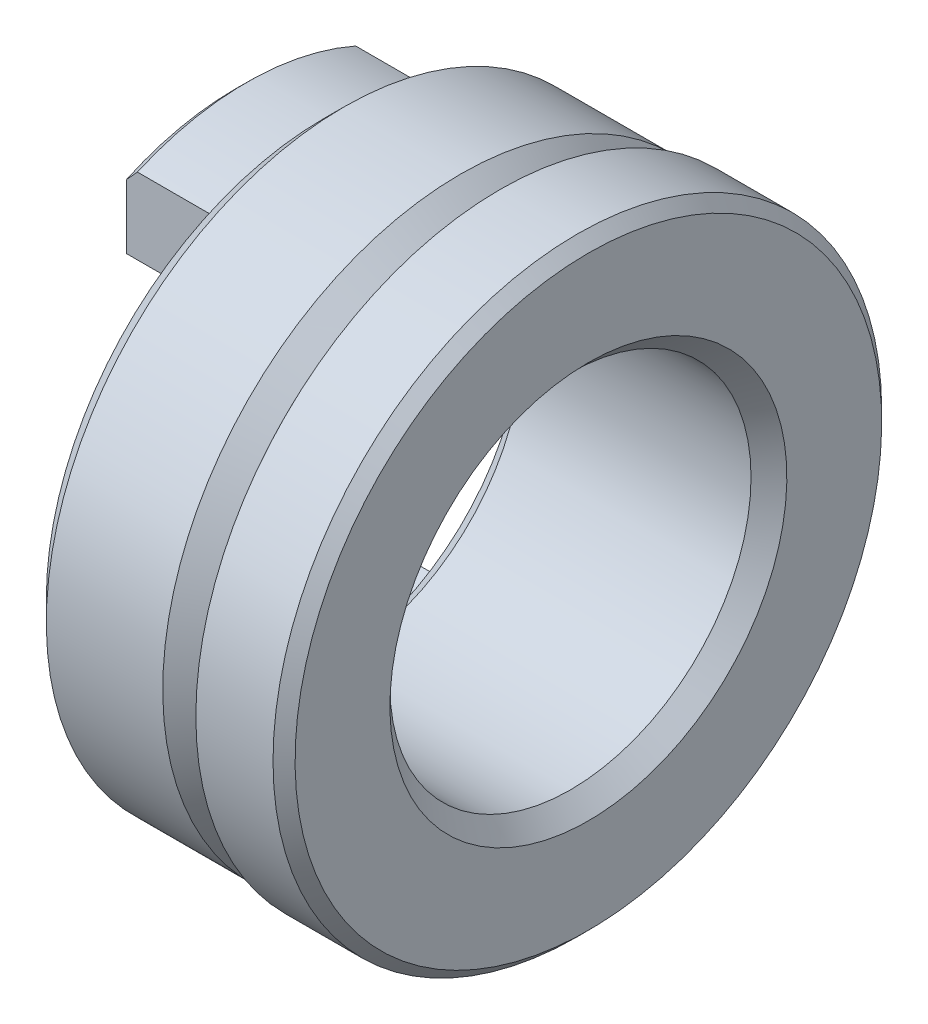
ISO-10303-21;
HEADER;
FILE_DESCRIPTION(('STEP AP214'),'2;1');
FILE_NAME('part.step','',(''),(''),'','','');
FILE_SCHEMA(('AUTOMOTIVE_DESIGN { 1 0 10303 214 1 1 1 1 }'));
ENDSEC;
DATA;
#1=APPLICATION_CONTEXT('core data for automotive mechanical design processes');
#2=APPLICATION_PROTOCOL_DEFINITION('international standard','automotive_design',2000,#1);
#3=PRODUCT_CONTEXT('',#1,'mechanical');
#4=PRODUCT('Part','Part','',(#3));
#5=PRODUCT_RELATED_PRODUCT_CATEGORY('part','',(#4));
#6=PRODUCT_DEFINITION_FORMATION('','',#4);
#7=PRODUCT_DEFINITION_CONTEXT('part definition',#1,'design');
#8=PRODUCT_DEFINITION('design','',#6,#7);
#9=PRODUCT_DEFINITION_SHAPE('','',#8);
#10=(LENGTH_UNIT() NAMED_UNIT(*) SI_UNIT(.MILLI.,.METRE.));
#11=(NAMED_UNIT(*) PLANE_ANGLE_UNIT() SI_UNIT($,.RADIAN.));
#12=(NAMED_UNIT(*) SI_UNIT($,.STERADIAN.) SOLID_ANGLE_UNIT());
#13=UNCERTAINTY_MEASURE_WITH_UNIT(LENGTH_MEASURE(1.E-05),#10,'distance_accuracy_value','');
#14=(GEOMETRIC_REPRESENTATION_CONTEXT(3) GLOBAL_UNCERTAINTY_ASSIGNED_CONTEXT((#13)) GLOBAL_UNIT_ASSIGNED_CONTEXT((#10,
#11,#12)) REPRESENTATION_CONTEXT('',''));
#15=CARTESIAN_POINT('',(0.,0.,0.));
#16=DIRECTION('',(0.,0.,1.));
#17=DIRECTION('',(1.,0.,0.));
#18=AXIS2_PLACEMENT_3D('',#15,#16,#17);
#19=CARTESIAN_POINT('',(-11.5,0.,0.));
#20=DIRECTION('',(1.,0.,0.));
#21=DIRECTION('',(0.,1.,0.));
#22=AXIS2_PLACEMENT_3D('',#19,#20,#21);
#23=CONICAL_SURFACE('',#22,12.25,0.785398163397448);
#24=CARTESIAN_POINT('',(-11.5,0.,0.));
#25=DIRECTION('',(1.,0.,0.));
#26=DIRECTION('',(0.,1.,0.));
#27=AXIS2_PLACEMENT_3D('',#24,#25,#26);
#28=CIRCLE('',#27,12.25);
#29=CARTESIAN_POINT('',(-11.5,11.2053558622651,-4.95));
#30=VERTEX_POINT('',#29);
#31=CARTESIAN_POINT('',(-11.5,11.2053558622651,4.95));
#32=VERTEX_POINT('',#31);
#33=EDGE_CURVE('E145',#30,#32,#28,.T.);
#34=ORIENTED_EDGE('',*,*,#33,.F.);
#35=CARTESIAN_POINT('',(3.20326090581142,26.4948254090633,-4.95));
#36=CARTESIAN_POINT('',(2.51381405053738,25.7934123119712,-4.95));
#37=CARTESIAN_POINT('',(1.82480125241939,25.0915713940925,-4.95));
#38=CARTESIAN_POINT('',(0.447152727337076,23.6858558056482,-4.95));
#39=CARTESIAN_POINT('',(-0.241481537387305,22.9819797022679,-4.95));
#40=CARTESIAN_POINT('',(-1.6317818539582,21.5577677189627,-4.95));
#41=CARTESIAN_POINT('',(-2.33341459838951,20.8373993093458,-4.95));
#42=CARTESIAN_POINT('',(-3.73364260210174,19.3954075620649,-4.95));
#43=CARTESIAN_POINT('',(-4.43224050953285,18.6737867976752,-4.95));
#44=CARTESIAN_POINT('',(-5.70449622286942,17.3540438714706,-4.95));
#45=CARTESIAN_POINT('',(-6.2786406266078,16.7563911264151,-4.95));
#46=CARTESIAN_POINT('',(-7.42418169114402,15.5582993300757,-4.95));
#47=CARTESIAN_POINT('',(-7.99557796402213,14.9578599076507,-4.95));
#48=CARTESIAN_POINT('',(-9.13703721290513,13.7504675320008,-4.95));
#49=CARTESIAN_POINT('',(-9.70708198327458,13.1434973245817,-4.95));
#50=CARTESIAN_POINT('',(-10.5575651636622,12.2290725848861,-4.95));
#51=CARTESIAN_POINT('',(-10.8402227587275,11.9236825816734,-4.95));
#52=CARTESIAN_POINT('',(-11.403690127,11.3112036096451,-4.95));
#53=CARTESIAN_POINT('',(-11.6844999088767,11.004114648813,-4.95));
#54=CARTESIAN_POINT('',(-12.2386008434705,10.3935530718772,-4.95));
#55=CARTESIAN_POINT('',(-12.5119347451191,10.0901192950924,-4.95));
#56=CARTESIAN_POINT('',(-13.0557524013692,9.48068414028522,-4.95));
#57=CARTESIAN_POINT('',(-13.3262360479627,9.17468266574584,-4.95));
#58=CARTESIAN_POINT('',(-13.8640261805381,8.55877296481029,-4.95));
#59=CARTESIAN_POINT('',(-14.1313249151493,8.2488579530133,-4.95));
#60=CARTESIAN_POINT('',(-14.6608555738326,7.62478406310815,-4.95));
#61=CARTESIAN_POINT('',(-14.9230881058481,7.31062570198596,-4.95));
#62=CARTESIAN_POINT('',(-15.4383054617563,6.67943613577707,-4.95));
#63=CARTESIAN_POINT('',(-15.691351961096,6.36245564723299,-4.95));
#64=CARTESIAN_POINT('',(-16.063615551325,5.88117802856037,-4.95));
#65=CARTESIAN_POINT('',(-16.1865214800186,5.71973505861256,-4.95));
#66=CARTESIAN_POINT('',(-16.4293129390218,5.39459735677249,-4.95));
#67=CARTESIAN_POINT('',(-16.5491985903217,5.2309027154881,-4.95));
#68=CARTESIAN_POINT('',(-16.784840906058,4.90144336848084,-4.95));
#69=CARTESIAN_POINT('',(-16.9006107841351,4.73568814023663,-4.95));
#70=CARTESIAN_POINT('',(-17.1275768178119,4.40103606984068,-4.95));
#71=CARTESIAN_POINT('',(-17.238772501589,4.23213890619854,-4.95));
#72=CARTESIAN_POINT('',(-17.455258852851,3.89084287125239,-4.95));
#73=CARTESIAN_POINT('',(-17.5605557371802,3.71844795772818,-4.95));
#74=CARTESIAN_POINT('',(-17.7637613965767,3.36937633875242,-4.95));
#75=CARTESIAN_POINT('',(-17.8616724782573,3.19270099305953,-4.95));
#76=CARTESIAN_POINT('',(-17.9750571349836,2.97465361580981,-4.95));
#77=CARTESIAN_POINT('',(-17.9950675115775,2.93562401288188,-4.95));
#78=CARTESIAN_POINT('',(-18.034614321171,2.85731987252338,-4.95));
#79=CARTESIAN_POINT('',(-18.0541507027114,2.81804530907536,-4.95));
#80=CARTESIAN_POINT('',(-18.1120142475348,2.69983458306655,-4.95));
#81=CARTESIAN_POINT('',(-18.1495874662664,2.62052738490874,-4.95));
#82=CARTESIAN_POINT('',(-18.2224864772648,2.46088367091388,-4.95));
#83=CARTESIAN_POINT('',(-18.257812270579,2.38054715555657,-4.95));
#84=CARTESIAN_POINT('',(-18.325952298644,2.21882193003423,-4.95));
#85=CARTESIAN_POINT('',(-18.3587666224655,2.13743325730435,-4.95));
#86=CARTESIAN_POINT('',(-18.4523269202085,1.8934719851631,-4.95));
#87=CARTESIAN_POINT('',(-18.5090216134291,1.72930986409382,-4.95));
#88=CARTESIAN_POINT('',(-18.6091069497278,1.39691062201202,-4.95));
#89=CARTESIAN_POINT('',(-18.6524970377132,1.22867333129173,-4.95));
#90=CARTESIAN_POINT('',(-18.7178372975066,0.916284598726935,-4.95));
#91=CARTESIAN_POINT('',(-18.7421164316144,0.772623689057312,-4.95));
#92=CARTESIAN_POINT('',(-18.778476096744,0.483789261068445,-4.95));
#93=CARTESIAN_POINT('',(-18.7905607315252,0.338616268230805,-4.95));
#94=CARTESIAN_POINT('',(-18.8018909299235,0.0480543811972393,-4.95));
#95=CARTESIAN_POINT('',(-18.8011622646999,-0.0973334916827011,-4.95));
#96=CARTESIAN_POINT('',(-18.7869727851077,-0.387503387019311,-4.95));
#97=CARTESIAN_POINT('',(-18.7735091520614,-0.532285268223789,-4.95));
#98=CARTESIAN_POINT('',(-18.7298220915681,-0.855001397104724,-4.95));
#99=CARTESIAN_POINT('',(-18.6963352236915,-1.03249370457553,-4.95));
#100=CARTESIAN_POINT('',(-18.6130909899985,-1.38365906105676,-4.95));
#101=CARTESIAN_POINT('',(-18.5633238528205,-1.55732974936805,-4.95));
#102=CARTESIAN_POINT('',(-18.4783589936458,-1.81503351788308,-4.95));
#103=CARTESIAN_POINT('',(-18.4481897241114,-1.90077407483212,-4.95));
#104=CARTESIAN_POINT('',(-18.3847787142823,-2.07107213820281,-4.95));
#105=CARTESIAN_POINT('',(-18.3515383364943,-2.15563015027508,-4.95));
#106=CARTESIAN_POINT('',(-18.2823016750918,-2.32359220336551,-4.95));
#107=CARTESIAN_POINT('',(-18.246305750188,-2.40699639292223,-4.95));
#108=CARTESIAN_POINT('',(-18.1718449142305,-2.57270085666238,-4.95));
#109=CARTESIAN_POINT('',(-18.133379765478,-2.65500102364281,-4.95));
#110=CARTESIAN_POINT('',(-18.0132493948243,-2.90328628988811,-4.95));
#111=CARTESIAN_POINT('',(-17.9281269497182,-3.0676042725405,-4.95));
#112=CARTESIAN_POINT('',(-17.7506773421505,-3.39232358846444,-4.95));
#113=CARTESIAN_POINT('',(-17.658347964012,-3.55272369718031,-4.95));
#114=CARTESIAN_POINT('',(-17.4678667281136,-3.87025164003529,-4.95));
#115=CARTESIAN_POINT('',(-17.3697086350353,-4.02737571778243,-4.95));
#116=CARTESIAN_POINT('',(-17.1688084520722,-4.3386292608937,-4.95));
#117=CARTESIAN_POINT('',(-17.0660668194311,-4.49275902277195,-4.95));
#118=CARTESIAN_POINT('',(-16.8564338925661,-4.79909155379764,-4.95));
#119=CARTESIAN_POINT('',(-16.7495273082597,-4.95128382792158,-4.95));
#120=CARTESIAN_POINT('',(-16.5326365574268,-5.25346331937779,-4.95));
#121=CARTESIAN_POINT('',(-16.4226522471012,-5.40345043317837,-4.95));
#122=CARTESIAN_POINT('',(-16.0890489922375,-5.85039720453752,-4.95));
#123=CARTESIAN_POINT('',(-15.8616473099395,-6.14453283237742,-4.95));
#124=CARTESIAN_POINT('',(-15.3966029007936,-6.73119776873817,-4.95));
#125=CARTESIAN_POINT('',(-15.1588620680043,-7.02364868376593,-4.95));
#126=CARTESIAN_POINT('',(-14.6780696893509,-7.60420077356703,-4.95));
#127=CARTESIAN_POINT('',(-14.4350175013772,-7.89230141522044,-4.95));
#128=CARTESIAN_POINT('',(-13.9456035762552,-8.46436849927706,-4.95));
#129=CARTESIAN_POINT('',(-13.6992521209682,-8.74834376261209,-4.95));
#130=CARTESIAN_POINT('',(-13.2035415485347,-9.31363034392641,-4.95));
#131=CARTESIAN_POINT('',(-12.9541825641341,-9.59494177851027,-4.95));
#132=CARTESIAN_POINT('',(-12.3745237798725,-10.2433504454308,-4.95));
#133=CARTESIAN_POINT('',(-12.0433671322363,-10.6096809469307,-4.95));
#134=CARTESIAN_POINT('',(-11.3780152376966,-11.3395747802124,-4.95));
#135=CARTESIAN_POINT('',(-11.0438199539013,-11.7031380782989,-4.95));
#136=CARTESIAN_POINT('',(-10.373083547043,-12.4281263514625,-4.95));
#137=CARTESIAN_POINT('',(-10.0365423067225,-12.789551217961,-4.95));
#138=CARTESIAN_POINT('',(-9.36163066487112,-13.5106898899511,-4.95));
#139=CARTESIAN_POINT('',(-9.02326025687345,-13.870403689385,-4.95));
#140=CARTESIAN_POINT('',(-8.00515322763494,-14.9483738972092,-4.95));
#141=CARTESIAN_POINT('',(-7.32324177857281,-15.664575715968,-4.95));
#142=CARTESIAN_POINT('',(-5.95560480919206,-17.0932835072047,-4.95));
#143=CARTESIAN_POINT('',(-5.26987939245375,-17.8057895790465,-4.95));
#144=CARTESIAN_POINT('',(-3.93689092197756,-19.1855819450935,-4.95));
#145=CARTESIAN_POINT('',(-3.28978485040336,-19.8530199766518,-4.95));
#146=CARTESIAN_POINT('',(-1.9937971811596,-21.1861801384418,-4.95));
#147=CARTESIAN_POINT('',(-1.34491556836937,-21.8519022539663,-4.95));
#148=CARTESIAN_POINT('',(-0.0467417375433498,-23.1810775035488,-4.95));
#149=CARTESIAN_POINT('',(0.602548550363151,-23.8445325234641,-4.95));
#150=CARTESIAN_POINT('',(1.90218259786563,-25.1703951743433,-4.95));
#151=CARTESIAN_POINT('',(2.55252634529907,-25.8328028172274,-4.95));
#152=CARTESIAN_POINT('',(3.20326090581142,-26.4948254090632,-4.95));
#153=B_SPLINE_CURVE_WITH_KNOTS('',3,(#35,#36,#37,#38,#39,#40,#41,#42,#43,#44,#45,#46,#47,#48,
#49,#50,#51,#52,#53,#54,#55,#56,#57,#58,#59,#60,#61,#62,#63,#64,#65,#66,#67,#68,#69,#70,#71,#72,
#73,#74,#75,#76,#77,#78,#79,#80,#81,#82,#83,#84,#85,#86,#87,#88,#89,#90,#91,#92,#93,#94,#95,#96,
#97,#98,#99,#100,#101,#102,#103,#104,#105,#106,#107,#108,#109,#110,#111,#112,#113,#114,#115,
#116,#117,#118,#119,#120,#121,#122,#123,#124,#125,#126,#127,#128,#129,#130,#131,#132,#133,#134,
#135,#136,#137,#138,#139,#140,#141,#142,#143,#144,#145,#146,#147,#148,#149,#150,#151,#152),
.UNSPECIFIED.,.F.,.F.,(4,2,2,2,2,2,2,2,2,2,2,2,2,2,2,2,2,2,2,2,2,2,2,2,2,2,2,2,2,2,2,2,2,2,2,2,
2,2,2,2,2,2,2,2,2,2,2,2,2,2,2,2,2,2,2,2,2,2,4),(0.,2.95056977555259,5.90470569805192,
8.92148419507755,11.9346122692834,14.420862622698,16.9074541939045,19.4054771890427,
20.6538405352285,21.9021980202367,23.1273580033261,24.3525642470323,25.5803111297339,
26.807909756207,28.024544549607,28.6332271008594,29.2418852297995,29.848370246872,
30.4549176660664,31.0608133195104,31.6665189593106,31.7980976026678,31.9296904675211,
32.1929303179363,32.456170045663,32.7194004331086,33.2399398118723,33.7605009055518,
34.1971225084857,34.6335971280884,35.0691939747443,35.5048872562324,36.0458505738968,
36.5871391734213,36.8597718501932,37.1322841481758,37.4047610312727,37.6772641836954,
38.2321818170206,38.7872707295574,39.34296454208,39.898603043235,40.4565202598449,
41.0144635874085,42.129654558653,43.260259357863,44.3910016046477,45.5187955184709,
46.6465398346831,48.1279894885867,49.6094571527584,51.0909994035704,52.5725468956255,
55.5392597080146,58.5058923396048,61.2947905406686,64.0837125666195,66.8686267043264,
69.6535089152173),.UNSPECIFIED.);
#154=CARTESIAN_POINT('',(-12.,10.6564534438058,-4.95));
#155=VERTEX_POINT('',#154);
#156=EDGE_CURVE('E210',#30,#155,#153,.T.);
#157=ORIENTED_EDGE('',*,*,#156,.T.);
#158=CARTESIAN_POINT('',(-12.,0.,0.));
#159=DIRECTION('',(1.,0.,0.));
#160=DIRECTION('',(0.,1.,0.));
#161=AXIS2_PLACEMENT_3D('',#158,#159,#160);
#162=CIRCLE('',#161,11.75);
#163=CARTESIAN_POINT('',(-12.,10.6564534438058,4.95));
#164=VERTEX_POINT('',#163);
#165=EDGE_CURVE('E123',#155,#164,#162,.T.);
#166=ORIENTED_EDGE('',*,*,#165,.T.);
#167=CARTESIAN_POINT('',(3.20326090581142,-26.4948254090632,4.95));
#168=CARTESIAN_POINT('',(2.51381405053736,-25.7934123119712,4.95));
#169=CARTESIAN_POINT('',(1.82480125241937,-25.0915713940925,4.95));
#170=CARTESIAN_POINT('',(0.44715272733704,-23.6858558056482,4.95));
#171=CARTESIAN_POINT('',(-0.241481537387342,-22.9819797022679,4.95));
#172=CARTESIAN_POINT('',(-1.63178185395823,-21.5577677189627,4.95));
#173=CARTESIAN_POINT('',(-2.33341459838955,-20.8373993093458,4.95));
#174=CARTESIAN_POINT('',(-3.73364260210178,-19.3954075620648,4.95));
#175=CARTESIAN_POINT('',(-4.43224050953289,-18.6737867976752,4.95));
#176=CARTESIAN_POINT('',(-5.70449622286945,-17.3540438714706,4.95));
#177=CARTESIAN_POINT('',(-6.27864062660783,-16.7563911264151,4.95));
#178=CARTESIAN_POINT('',(-7.42418169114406,-15.5582993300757,4.95));
#179=CARTESIAN_POINT('',(-7.99557796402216,-14.9578599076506,4.95));
#180=CARTESIAN_POINT('',(-9.13703721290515,-13.7504675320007,4.95));
#181=CARTESIAN_POINT('',(-9.70708198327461,-13.1434973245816,4.95));
#182=CARTESIAN_POINT('',(-10.5575651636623,-12.2290725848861,4.95));
#183=CARTESIAN_POINT('',(-10.8402227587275,-11.9236825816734,4.95));
#184=CARTESIAN_POINT('',(-11.403690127,-11.3112036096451,4.95));
#185=CARTESIAN_POINT('',(-11.6844999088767,-11.004114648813,4.95));
#186=CARTESIAN_POINT('',(-12.2386008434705,-10.3935530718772,4.95));
#187=CARTESIAN_POINT('',(-12.5119347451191,-10.0901192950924,4.95));
#188=CARTESIAN_POINT('',(-13.0557524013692,-9.48068414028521,4.95));
#189=CARTESIAN_POINT('',(-13.3262360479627,-9.17468266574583,4.95));
#190=CARTESIAN_POINT('',(-13.8640261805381,-8.55877296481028,4.95));
#191=CARTESIAN_POINT('',(-14.1313249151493,-8.24885795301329,4.95));
#192=CARTESIAN_POINT('',(-14.6608555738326,-7.62478406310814,4.95));
#193=CARTESIAN_POINT('',(-14.9230881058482,-7.31062570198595,4.95));
#194=CARTESIAN_POINT('',(-15.4383054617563,-6.67943613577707,4.95));
#195=CARTESIAN_POINT('',(-15.6913519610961,-6.36245564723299,4.95));
#196=CARTESIAN_POINT('',(-16.063615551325,-5.88117802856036,4.95));
#197=CARTESIAN_POINT('',(-16.1865214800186,-5.71973505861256,4.95));
#198=CARTESIAN_POINT('',(-16.4293129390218,-5.39459735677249,4.95));
#199=CARTESIAN_POINT('',(-16.5491985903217,-5.2309027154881,4.95));
#200=CARTESIAN_POINT('',(-16.784840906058,-4.90144336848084,4.95));
#201=CARTESIAN_POINT('',(-16.9006107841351,-4.73568814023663,4.95));
#202=CARTESIAN_POINT('',(-17.1275768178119,-4.40103606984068,4.95));
#203=CARTESIAN_POINT('',(-17.238772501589,-4.23213890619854,4.95));
#204=CARTESIAN_POINT('',(-17.455258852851,-3.89084287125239,4.95));
#205=CARTESIAN_POINT('',(-17.5605557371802,-3.71844795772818,4.95));
#206=CARTESIAN_POINT('',(-17.7637613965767,-3.36937633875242,4.95));
#207=CARTESIAN_POINT('',(-17.8616724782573,-3.19270099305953,4.95));
#208=CARTESIAN_POINT('',(-17.9750571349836,-2.97465361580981,4.95));
#209=CARTESIAN_POINT('',(-17.9950675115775,-2.93562401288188,4.95));
#210=CARTESIAN_POINT('',(-18.034614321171,-2.85731987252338,4.95));
#211=CARTESIAN_POINT('',(-18.0541507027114,-2.81804530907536,4.95));
#212=CARTESIAN_POINT('',(-18.1120142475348,-2.69983458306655,4.95));
#213=CARTESIAN_POINT('',(-18.1495874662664,-2.62052738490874,4.95));
#214=CARTESIAN_POINT('',(-18.2224864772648,-2.46088367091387,4.95));
#215=CARTESIAN_POINT('',(-18.257812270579,-2.38054715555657,4.95));
#216=CARTESIAN_POINT('',(-18.325952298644,-2.21882193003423,4.95));
#217=CARTESIAN_POINT('',(-18.3587666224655,-2.13743325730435,4.95));
#218=CARTESIAN_POINT('',(-18.4523269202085,-1.8934719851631,4.95));
#219=CARTESIAN_POINT('',(-18.5090216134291,-1.72930986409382,4.95));
#220=CARTESIAN_POINT('',(-18.6091069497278,-1.39691062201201,4.95));
#221=CARTESIAN_POINT('',(-18.6524970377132,-1.22867333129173,4.95));
#222=CARTESIAN_POINT('',(-18.7178372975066,-0.916284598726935,4.95));
#223=CARTESIAN_POINT('',(-18.7421164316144,-0.772623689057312,4.95));
#224=CARTESIAN_POINT('',(-18.778476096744,-0.483789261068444,4.95));
#225=CARTESIAN_POINT('',(-18.7905607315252,-0.338616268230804,4.95));
#226=CARTESIAN_POINT('',(-18.8018909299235,-0.0480543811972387,4.95));
#227=CARTESIAN_POINT('',(-18.8011622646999,0.0973334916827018,4.95));
#228=CARTESIAN_POINT('',(-18.7869727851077,0.387503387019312,4.95));
#229=CARTESIAN_POINT('',(-18.7735091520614,0.532285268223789,4.95));
#230=CARTESIAN_POINT('',(-18.7298220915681,0.855001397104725,4.95));
#231=CARTESIAN_POINT('',(-18.6963352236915,1.03249370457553,4.95));
#232=CARTESIAN_POINT('',(-18.6130909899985,1.38365906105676,4.95));
#233=CARTESIAN_POINT('',(-18.5633238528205,1.55732974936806,4.95));
#234=CARTESIAN_POINT('',(-18.4783589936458,1.81503351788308,4.95));
#235=CARTESIAN_POINT('',(-18.4481897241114,1.90077407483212,4.95));
#236=CARTESIAN_POINT('',(-18.3847787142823,2.07107213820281,4.95));
#237=CARTESIAN_POINT('',(-18.3515383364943,2.15563015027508,4.95));
#238=CARTESIAN_POINT('',(-18.2823016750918,2.32359220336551,4.95));
#239=CARTESIAN_POINT('',(-18.246305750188,2.40699639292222,4.95));
#240=CARTESIAN_POINT('',(-18.1718449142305,2.57270085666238,4.95));
#241=CARTESIAN_POINT('',(-18.133379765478,2.65500102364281,4.95));
#242=CARTESIAN_POINT('',(-18.0132493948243,2.90328628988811,4.95));
#243=CARTESIAN_POINT('',(-17.9281269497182,3.0676042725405,4.95));
#244=CARTESIAN_POINT('',(-17.7506773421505,3.39232358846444,4.95));
#245=CARTESIAN_POINT('',(-17.658347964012,3.55272369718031,4.95));
#246=CARTESIAN_POINT('',(-17.4678667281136,3.87025164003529,4.95));
#247=CARTESIAN_POINT('',(-17.3697086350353,4.02737571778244,4.95));
#248=CARTESIAN_POINT('',(-17.1688084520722,4.3386292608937,4.95));
#249=CARTESIAN_POINT('',(-17.0660668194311,4.49275902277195,4.95));
#250=CARTESIAN_POINT('',(-16.8564338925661,4.79909155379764,4.95));
#251=CARTESIAN_POINT('',(-16.7495273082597,4.95128382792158,4.95));
#252=CARTESIAN_POINT('',(-16.5326365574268,5.2534633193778,4.95));
#253=CARTESIAN_POINT('',(-16.4226522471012,5.40345043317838,4.95));
#254=CARTESIAN_POINT('',(-16.0890489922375,5.85039720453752,4.95));
#255=CARTESIAN_POINT('',(-15.8616473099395,6.14453283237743,4.95));
#256=CARTESIAN_POINT('',(-15.3966029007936,6.73119776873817,4.95));
#257=CARTESIAN_POINT('',(-15.1588620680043,7.02364868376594,4.95));
#258=CARTESIAN_POINT('',(-14.6780696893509,7.60420077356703,4.95));
#259=CARTESIAN_POINT('',(-14.4350175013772,7.89230141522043,4.95));
#260=CARTESIAN_POINT('',(-13.9456035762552,8.46436849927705,4.95));
#261=CARTESIAN_POINT('',(-13.6992521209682,8.74834376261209,4.95));
#262=CARTESIAN_POINT('',(-13.2035415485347,9.31363034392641,4.95));
#263=CARTESIAN_POINT('',(-12.9541825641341,9.59494177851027,4.95));
#264=CARTESIAN_POINT('',(-12.3745237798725,10.2433504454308,4.95));
#265=CARTESIAN_POINT('',(-12.0433671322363,10.6096809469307,4.95));
#266=CARTESIAN_POINT('',(-11.3780152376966,11.3395747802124,4.95));
#267=CARTESIAN_POINT('',(-11.0438199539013,11.7031380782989,4.95));
#268=CARTESIAN_POINT('',(-10.373083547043,12.4281263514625,4.95));
#269=CARTESIAN_POINT('',(-10.0365423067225,12.789551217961,4.95));
#270=CARTESIAN_POINT('',(-9.36163066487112,13.5106898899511,4.95));
#271=CARTESIAN_POINT('',(-9.02326025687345,13.870403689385,4.95));
#272=CARTESIAN_POINT('',(-8.00515322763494,14.9483738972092,4.95));
#273=CARTESIAN_POINT('',(-7.32324177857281,15.664575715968,4.95));
#274=CARTESIAN_POINT('',(-5.95560480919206,17.0932835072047,4.95));
#275=CARTESIAN_POINT('',(-5.26987939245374,17.8057895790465,4.95));
#276=CARTESIAN_POINT('',(-3.93689092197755,19.1855819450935,4.95));
#277=CARTESIAN_POINT('',(-3.28978485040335,19.8530199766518,4.95));
#278=CARTESIAN_POINT('',(-1.99379718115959,21.1861801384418,4.95));
#279=CARTESIAN_POINT('',(-1.34491556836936,21.8519022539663,4.95));
#280=CARTESIAN_POINT('',(-0.0467417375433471,23.1810775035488,4.95));
#281=CARTESIAN_POINT('',(0.602548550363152,23.8445325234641,4.95));
#282=CARTESIAN_POINT('',(1.90218259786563,25.1703951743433,4.95));
#283=CARTESIAN_POINT('',(2.55252634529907,25.8328028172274,4.95));
#284=CARTESIAN_POINT('',(3.20326090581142,26.4948254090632,4.95));
#285=B_SPLINE_CURVE_WITH_KNOTS('',3,(#167,#168,#169,#170,#171,#172,#173,#174,#175,#176,#177,
#178,#179,#180,#181,#182,#183,#184,#185,#186,#187,#188,#189,#190,#191,#192,#193,#194,#195,#196,
#197,#198,#199,#200,#201,#202,#203,#204,#205,#206,#207,#208,#209,#210,#211,#212,#213,#214,#215,
#216,#217,#218,#219,#220,#221,#222,#223,#224,#225,#226,#227,#228,#229,#230,#231,#232,#233,#234,
#235,#236,#237,#238,#239,#240,#241,#242,#243,#244,#245,#246,#247,#248,#249,#250,#251,#252,#253,
#254,#255,#256,#257,#258,#259,#260,#261,#262,#263,#264,#265,#266,#267,#268,#269,#270,#271,#272,
#273,#274,#275,#276,#277,#278,#279,#280,#281,#282,#283,#284),.UNSPECIFIED.,.F.,.F.,(4,2,2,2,2,2,
2,2,2,2,2,2,2,2,2,2,2,2,2,2,2,2,2,2,2,2,2,2,2,2,2,2,2,2,2,2,2,2,2,2,2,2,2,2,2,2,2,2,2,2,2,2,2,2,
2,2,2,2,4),(0.,2.95056977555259,5.90470569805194,8.92148419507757,11.9346122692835,
14.420862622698,16.9074541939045,19.4054771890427,20.6538405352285,21.9021980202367,
23.1273580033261,24.3525642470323,25.5803111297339,26.8079097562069,28.0245445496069,
28.6332271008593,29.2418852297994,29.848370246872,30.4549176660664,31.0608133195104,
31.6665189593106,31.7980976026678,31.9296904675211,32.1929303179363,32.456170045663,
32.7194004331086,33.2399398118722,33.7605009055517,34.1971225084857,34.6335971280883,
35.0691939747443,35.5048872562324,36.0458505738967,36.5871391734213,36.8597718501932,
37.1322841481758,37.4047610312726,37.6772641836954,38.2321818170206,38.7872707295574,
39.34296454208,39.898603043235,40.4565202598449,41.0144635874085,42.1296545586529,
43.260259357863,44.3910016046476,45.5187955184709,46.646539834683,48.1279894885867,
49.6094571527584,51.0909994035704,52.5725468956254,55.5392597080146,58.5058923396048,
61.2947905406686,64.0837125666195,66.8686267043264,69.6535089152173),.UNSPECIFIED.);
#286=EDGE_CURVE('E212',#164,#32,#285,.T.);
#287=ORIENTED_EDGE('',*,*,#286,.T.);
#288=EDGE_LOOP('',(#34,#157,#166,#287));
#289=FACE_BOUND('',#288,.T.);
#290=ADVANCED_FACE('F14',(#289),#23,.T.);
#291=CARTESIAN_POINT('',(-12.,-10.6564534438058,4.95));
#292=VERTEX_POINT('',#291);
#293=CARTESIAN_POINT('',(-12.,-10.6564534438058,-4.95));
#294=VERTEX_POINT('',#293);
#295=EDGE_CURVE('E126',#292,#294,#162,.T.);
#296=ORIENTED_EDGE('',*,*,#295,.T.);
#297=CARTESIAN_POINT('',(-11.5,-11.2053558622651,-4.95));
#298=VERTEX_POINT('',#297);
#299=EDGE_CURVE('E108',#294,#298,#153,.T.);
#300=ORIENTED_EDGE('',*,*,#299,.T.);
#301=CARTESIAN_POINT('',(-11.5,-11.2053558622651,4.95));
#302=VERTEX_POINT('',#301);
#303=EDGE_CURVE('E135',#302,#298,#28,.T.);
#304=ORIENTED_EDGE('',*,*,#303,.F.);
#305=EDGE_CURVE('E436',#302,#292,#285,.T.);
#306=ORIENTED_EDGE('',*,*,#305,.T.);
#307=EDGE_LOOP('',(#296,#300,#304,#306));
#308=FACE_BOUND('',#307,.T.);
#309=ADVANCED_FACE('F198',(#308),#23,.T.);
#310=CARTESIAN_POINT('',(-12.,0.,11.75));
#311=DIRECTION('',(-1.,0.,0.));
#312=DIRECTION('',(0.,-1.,0.));
#313=AXIS2_PLACEMENT_3D('',#310,#311,#312);
#314=PLANE('',#313);
#315=ORIENTED_EDGE('',*,*,#165,.F.);
#316=DIRECTION('',(0.,1.,0.));
#317=VECTOR('',#316,1.);
#318=CARTESIAN_POINT('',(-12.,-20.,-4.95));
#319=LINE('',#318,#317);
#320=CARTESIAN_POINT('',(-12.,7.75483720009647,-4.95));
#321=VERTEX_POINT('',#320);
#322=EDGE_CURVE('E423',#321,#155,#319,.T.);
#323=ORIENTED_EDGE('',*,*,#322,.F.);
#324=CARTESIAN_POINT('',(-12.,0.,0.));
#325=DIRECTION('',(1.,0.,0.));
#326=DIRECTION('',(0.,1.,0.));
#327=AXIS2_PLACEMENT_3D('',#324,#325,#326);
#328=CIRCLE('',#327,9.2);
#329=CARTESIAN_POINT('',(-12.,7.75483720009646,4.95));
#330=VERTEX_POINT('',#329);
#331=EDGE_CURVE('E113',#321,#330,#328,.T.);
#332=ORIENTED_EDGE('',*,*,#331,.T.);
#333=DIRECTION('',(0.,1.,0.));
#334=VECTOR('',#333,1.);
#335=CARTESIAN_POINT('',(-12.,-20.,4.95));
#336=LINE('',#335,#334);
#337=EDGE_CURVE('E97',#330,#164,#336,.T.);
#338=ORIENTED_EDGE('',*,*,#337,.T.);
#339=EDGE_LOOP('',(#315,#323,#332,#338));
#340=FACE_BOUND('',#339,.T.);
#341=ADVANCED_FACE('F204',(#340),#314,.T.);
#342=CARTESIAN_POINT('',(-12.,-7.75483720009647,4.95));
#343=VERTEX_POINT('',#342);
#344=CARTESIAN_POINT('',(-12.,-7.75483720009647,-4.95));
#345=VERTEX_POINT('',#344);
#346=EDGE_CURVE('E107',#343,#345,#328,.T.);
#347=ORIENTED_EDGE('',*,*,#346,.T.);
#348=EDGE_CURVE('E424',#294,#345,#319,.T.);
#349=ORIENTED_EDGE('',*,*,#348,.F.);
#350=ORIENTED_EDGE('',*,*,#295,.F.);
#351=EDGE_CURVE('E425',#292,#343,#336,.T.);
#352=ORIENTED_EDGE('',*,*,#351,.T.);
#353=EDGE_LOOP('',(#347,#349,#350,#352));
#354=FACE_BOUND('',#353,.T.);
#355=ADVANCED_FACE('F397',(#354),#314,.T.);
#356=CARTESIAN_POINT('',(4.,0.,0.));
#357=DIRECTION('',(1.,0.,0.));
#358=DIRECTION('',(0.,1.,0.));
#359=AXIS2_PLACEMENT_3D('',#356,#357,#358);
#360=CYLINDRICAL_SURFACE('',#359,9.2);
#361=ORIENTED_EDGE('',*,*,#331,.F.);
#362=DIRECTION('',(1.,0.,0.));
#363=VECTOR('',#362,1.);
#364=CARTESIAN_POINT('',(4.,7.75483720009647,-4.95));
#365=LINE('',#364,#363);
#366=CARTESIAN_POINT('',(-8.,7.75483720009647,-4.95));
#367=VERTEX_POINT('',#366);
#368=EDGE_CURVE('E214',#321,#367,#365,.T.);
#369=ORIENTED_EDGE('',*,*,#368,.T.);
#370=CARTESIAN_POINT('',(-8.,0.,0.));
#371=DIRECTION('',(1.,0.,0.));
#372=DIRECTION('',(0.,1.,0.));
#373=AXIS2_PLACEMENT_3D('',#370,#371,#372);
#374=CIRCLE('',#373,9.2);
#375=CARTESIAN_POINT('',(-8.,7.75483720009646,4.95));
#376=VERTEX_POINT('',#375);
#377=EDGE_CURVE('E114',#367,#376,#374,.T.);
#378=ORIENTED_EDGE('',*,*,#377,.T.);
#379=DIRECTION('',(1.,0.,0.));
#380=VECTOR('',#379,1.);
#381=CARTESIAN_POINT('',(4.,7.75483720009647,4.95));
#382=LINE('',#381,#380);
#383=EDGE_CURVE('E109',#376,#330,#382,.F.);
#384=ORIENTED_EDGE('',*,*,#383,.T.);
#385=EDGE_LOOP('',(#361,#369,#378,#384));
#386=FACE_BOUND('',#385,.T.);
#387=ADVANCED_FACE('F404',(#386),#360,.F.);
#388=CARTESIAN_POINT('',(-8.,-7.75483720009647,4.95));
#389=VERTEX_POINT('',#388);
#390=CARTESIAN_POINT('',(-8.,-7.75483720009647,-4.95));
#391=VERTEX_POINT('',#390);
#392=EDGE_CURVE('E105',#389,#391,#374,.T.);
#393=ORIENTED_EDGE('',*,*,#392,.T.);
#394=DIRECTION('',(1.,0.,0.));
#395=VECTOR('',#394,1.);
#396=CARTESIAN_POINT('',(4.,-7.75483720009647,-4.95));
#397=LINE('',#396,#395);
#398=EDGE_CURVE('E216',#391,#345,#397,.F.);
#399=ORIENTED_EDGE('',*,*,#398,.T.);
#400=ORIENTED_EDGE('',*,*,#346,.F.);
#401=DIRECTION('',(1.,0.,0.));
#402=VECTOR('',#401,1.);
#403=CARTESIAN_POINT('',(4.,-7.75483720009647,4.95));
#404=LINE('',#403,#402);
#405=EDGE_CURVE('E92',#343,#389,#404,.T.);
#406=ORIENTED_EDGE('',*,*,#405,.T.);
#407=EDGE_LOOP('',(#393,#399,#400,#406));
#408=FACE_BOUND('',#407,.T.);
#409=ADVANCED_FACE('F103',(#408),#360,.F.);
#410=CARTESIAN_POINT('',(4.,0.,0.));
#411=DIRECTION('',(1.,0.,0.));
#412=DIRECTION('',(0.,1.,0.));
#413=AXIS2_PLACEMENT_3D('',#410,#411,#412);
#414=CYLINDRICAL_SURFACE('',#413,12.25);
#415=CARTESIAN_POINT('',(-8.,0.,0.));
#416=DIRECTION('',(1.,0.,0.));
#417=DIRECTION('',(0.,1.,0.));
#418=AXIS2_PLACEMENT_3D('',#415,#416,#417);
#419=CIRCLE('',#418,12.25);
#420=CARTESIAN_POINT('',(-8.,11.2053558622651,-4.95));
#421=VERTEX_POINT('',#420);
#422=CARTESIAN_POINT('',(-8.,11.2053558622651,4.95));
#423=VERTEX_POINT('',#422);
#424=EDGE_CURVE('E138',#421,#423,#419,.T.);
#425=ORIENTED_EDGE('',*,*,#424,.F.);
#426=DIRECTION('',(1.,0.,0.));
#427=VECTOR('',#426,1.);
#428=CARTESIAN_POINT('',(4.,11.2053558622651,-4.95));
#429=LINE('',#428,#427);
#430=EDGE_CURVE('E9',#421,#30,#429,.F.);
#431=ORIENTED_EDGE('',*,*,#430,.T.);
#432=ORIENTED_EDGE('',*,*,#33,.T.);
#433=DIRECTION('',(1.,0.,0.));
#434=VECTOR('',#433,1.);
#435=CARTESIAN_POINT('',(4.,11.2053558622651,4.95));
#436=LINE('',#435,#434);
#437=EDGE_CURVE('E127',#32,#423,#436,.T.);
#438=ORIENTED_EDGE('',*,*,#437,.T.);
#439=EDGE_LOOP('',(#425,#431,#432,#438));
#440=FACE_BOUND('',#439,.T.);
#441=ADVANCED_FACE('F194',(#440),#414,.T.);
#442=ORIENTED_EDGE('',*,*,#303,.T.);
#443=DIRECTION('',(1.,0.,0.));
#444=VECTOR('',#443,1.);
#445=CARTESIAN_POINT('',(4.,-11.2053558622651,-4.95));
#446=LINE('',#445,#444);
#447=CARTESIAN_POINT('',(-8.,-11.2053558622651,-4.95));
#448=VERTEX_POINT('',#447);
#449=EDGE_CURVE('E22',#298,#448,#446,.T.);
#450=ORIENTED_EDGE('',*,*,#449,.T.);
#451=CARTESIAN_POINT('',(-8.,-11.2053558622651,4.95));
#452=VERTEX_POINT('',#451);
#453=EDGE_CURVE('E133',#452,#448,#419,.T.);
#454=ORIENTED_EDGE('',*,*,#453,.F.);
#455=DIRECTION('',(1.,0.,0.));
#456=VECTOR('',#455,1.);
#457=CARTESIAN_POINT('',(4.,-11.2053558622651,4.95));
#458=LINE('',#457,#456);
#459=EDGE_CURVE('E95',#452,#302,#458,.F.);
#460=ORIENTED_EDGE('',*,*,#459,.T.);
#461=EDGE_LOOP('',(#442,#450,#454,#460));
#462=FACE_BOUND('',#461,.T.);
#463=ADVANCED_FACE('F132',(#462),#414,.T.);
#464=CARTESIAN_POINT('',(-8.,0.,0.));
#465=DIRECTION('',(-1.,0.,0.));
#466=DIRECTION('',(0.,-1.,0.));
#467=AXIS2_PLACEMENT_3D('',#464,#465,#466);
#468=CONICAL_SURFACE('',#467,9.,0.785398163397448);
#469=CARTESIAN_POINT('',(-7.188,0.,0.));
#470=DIRECTION('',(1.,0.,0.));
#471=DIRECTION('',(0.,1.,0.));
#472=AXIS2_PLACEMENT_3D('',#469,#470,#471);
#473=CIRCLE('',#472,8.188);
#474=CARTESIAN_POINT('',(-7.188,8.188,0.));
#475=VERTEX_POINT('',#474);
#476=EDGE_CURVE('E173',#475,#475,#473,.T.);
#477=ORIENTED_EDGE('',*,*,#476,.T.);
#478=EDGE_LOOP('',(#477));
#479=FACE_BOUND('',#478,.T.);
#480=CARTESIAN_POINT('',(-8.,0.,0.));
#481=DIRECTION('',(1.,0.,0.));
#482=DIRECTION('',(0.,1.,0.));
#483=AXIS2_PLACEMENT_3D('',#480,#481,#482);
#484=CIRCLE('',#483,9.);
#485=CARTESIAN_POINT('',(-8.,9.,0.));
#486=VERTEX_POINT('',#485);
#487=EDGE_CURVE('E119',#486,#486,#484,.T.);
#488=ORIENTED_EDGE('',*,*,#487,.F.);
#489=EDGE_LOOP('',(#488));
#490=FACE_BOUND('',#489,.T.);
#491=ADVANCED_FACE('F181',(#479,#490),#468,.F.);
#492=CARTESIAN_POINT('',(4.,0.,0.));
#493=DIRECTION('',(1.,0.,0.));
#494=DIRECTION('',(0.,1.,0.));
#495=AXIS2_PLACEMENT_3D('',#492,#493,#494);
#496=CYLINDRICAL_SURFACE('',#495,8.188);
#497=CARTESIAN_POINT('',(3.188,0.,0.));
#498=DIRECTION('',(1.,0.,0.));
#499=DIRECTION('',(0.,1.,0.));
#500=AXIS2_PLACEMENT_3D('',#497,#498,#499);
#501=CIRCLE('',#500,8.188);
#502=CARTESIAN_POINT('',(3.188,8.188,0.));
#503=VERTEX_POINT('',#502);
#504=EDGE_CURVE('E171',#503,#503,#501,.T.);
#505=ORIENTED_EDGE('',*,*,#504,.T.);
#506=EDGE_LOOP('',(#505));
#507=FACE_BOUND('',#506,.T.);
#508=ORIENTED_EDGE('',*,*,#476,.F.);
#509=EDGE_LOOP('',(#508));
#510=FACE_BOUND('',#509,.T.);
#511=ADVANCED_FACE('F183',(#507,#510),#496,.F.);
#512=CARTESIAN_POINT('',(3.188,0.,0.));
#513=DIRECTION('',(1.,0.,0.));
#514=DIRECTION('',(0.,1.,0.));
#515=AXIS2_PLACEMENT_3D('',#512,#513,#514);
#516=CONICAL_SURFACE('',#515,8.188,0.785398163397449);
#517=CARTESIAN_POINT('',(4.,0.,0.));
#518=DIRECTION('',(1.,0.,0.));
#519=DIRECTION('',(0.,1.,0.));
#520=AXIS2_PLACEMENT_3D('',#517,#518,#519);
#521=CIRCLE('',#520,9.);
#522=CARTESIAN_POINT('',(4.,9.,0.));
#523=VERTEX_POINT('',#522);
#524=EDGE_CURVE('E168',#523,#523,#521,.T.);
#525=ORIENTED_EDGE('',*,*,#524,.T.);
#526=EDGE_LOOP('',(#525));
#527=FACE_BOUND('',#526,.T.);
#528=ORIENTED_EDGE('',*,*,#504,.F.);
#529=EDGE_LOOP('',(#528));
#530=FACE_BOUND('',#529,.T.);
#531=ADVANCED_FACE('F191',(#527,#530),#516,.F.);
#532=CARTESIAN_POINT('',(4.,0.,9.));
#533=DIRECTION('',(1.,0.,0.));
#534=DIRECTION('',(0.,1.,0.));
#535=AXIS2_PLACEMENT_3D('',#532,#533,#534);
#536=PLANE('',#535);
#537=CARTESIAN_POINT('',(4.,0.,0.));
#538=DIRECTION('',(1.,0.,0.));
#539=DIRECTION('',(0.,1.,0.));
#540=AXIS2_PLACEMENT_3D('',#537,#538,#539);
#541=CIRCLE('',#540,13.3);
#542=CARTESIAN_POINT('',(4.,13.3,0.));
#543=VERTEX_POINT('',#542);
#544=EDGE_CURVE('E165',#543,#543,#541,.T.);
#545=ORIENTED_EDGE('',*,*,#544,.T.);
#546=EDGE_LOOP('',(#545));
#547=FACE_BOUND('',#546,.T.);
#548=ORIENTED_EDGE('',*,*,#524,.F.);
#549=EDGE_LOOP('',(#548));
#550=FACE_BOUND('',#549,.T.);
#551=ADVANCED_FACE('F266',(#547,#550),#536,.T.);
#552=CARTESIAN_POINT('',(4.,0.,0.));
#553=DIRECTION('',(-1.,0.,0.));
#554=DIRECTION('',(0.,-1.,0.));
#555=AXIS2_PLACEMENT_3D('',#552,#553,#554);
#556=CONICAL_SURFACE('',#555,13.3,0.78539816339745);
#557=CARTESIAN_POINT('',(3.5,0.,0.));
#558=DIRECTION('',(1.,0.,0.));
#559=DIRECTION('',(0.,1.,0.));
#560=AXIS2_PLACEMENT_3D('',#557,#558,#559);
#561=CIRCLE('',#560,13.8);
#562=CARTESIAN_POINT('',(3.5,13.8,0.));
#563=VERTEX_POINT('',#562);
#564=EDGE_CURVE('E162',#563,#563,#561,.T.);
#565=ORIENTED_EDGE('',*,*,#564,.T.);
#566=EDGE_LOOP('',(#565));
#567=FACE_BOUND('',#566,.T.);
#568=ORIENTED_EDGE('',*,*,#544,.F.);
#569=EDGE_LOOP('',(#568));
#570=FACE_BOUND('',#569,.T.);
#571=ADVANCED_FACE('F262',(#567,#570),#556,.T.);
#572=CARTESIAN_POINT('',(4.,0.,0.));
#573=DIRECTION('',(1.,0.,0.));
#574=DIRECTION('',(0.,1.,0.));
#575=AXIS2_PLACEMENT_3D('',#572,#573,#574);
#576=CYLINDRICAL_SURFACE('',#575,13.8);
#577=CARTESIAN_POINT('',(0.,0.,0.));
#578=DIRECTION('',(1.,0.,0.));
#579=DIRECTION('',(0.,1.,0.));
#580=AXIS2_PLACEMENT_3D('',#577,#578,#579);
#581=CIRCLE('',#580,13.8);
#582=CARTESIAN_POINT('',(0.,13.8,0.));
#583=VERTEX_POINT('',#582);
#584=EDGE_CURVE('E159',#583,#583,#581,.T.);
#585=ORIENTED_EDGE('',*,*,#584,.T.);
#586=EDGE_LOOP('',(#585));
#587=FACE_BOUND('',#586,.T.);
#588=ORIENTED_EDGE('',*,*,#564,.F.);
#589=EDGE_LOOP('',(#588));
#590=FACE_BOUND('',#589,.T.);
#591=ADVANCED_FACE('F258',(#587,#590),#576,.T.);
#592=CARTESIAN_POINT('',(0.,0.,13.8));
#593=DIRECTION('',(-1.,0.,0.));
#594=DIRECTION('',(0.,-1.,0.));
#595=AXIS2_PLACEMENT_3D('',#592,#593,#594);
#596=PLANE('',#595);
#597=CARTESIAN_POINT('',(0.,0.,0.));
#598=DIRECTION('',(1.,0.,0.));
#599=DIRECTION('',(0.,1.,0.));
#600=AXIS2_PLACEMENT_3D('',#597,#598,#599);
#601=CIRCLE('',#600,13.);
#602=CARTESIAN_POINT('',(0.,13.,0.));
#603=VERTEX_POINT('',#602);
#604=EDGE_CURVE('E156',#603,#603,#601,.T.);
#605=ORIENTED_EDGE('',*,*,#604,.T.);
#606=EDGE_LOOP('',(#605));
#607=FACE_BOUND('',#606,.T.);
#608=ORIENTED_EDGE('',*,*,#584,.F.);
#609=EDGE_LOOP('',(#608));
#610=FACE_BOUND('',#609,.T.);
#611=ADVANCED_FACE('F254',(#607,#610),#596,.T.);
#612=CARTESIAN_POINT('',(-0.5,0.,0.));
#613=DIRECTION('',(1.,0.,0.));
#614=DIRECTION('',(0.,1.,0.));
#615=AXIS2_PLACEMENT_3D('',#612,#613,#614);
#616=TOROIDAL_SURFACE('',#615,13.,0.5);
#617=ORIENTED_EDGE('',*,*,#604,.F.);
#618=EDGE_LOOP('',(#617));
#619=FACE_BOUND('',#618,.T.);
#620=CARTESIAN_POINT('',(-0.835051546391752,0.,0.));
#621=DIRECTION('',(1.,0.,0.));
#622=DIRECTION('',(0.,1.,0.));
#623=AXIS2_PLACEMENT_3D('',#620,#621,#622);
#624=CIRCLE('',#623,12.6288659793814);
#625=CARTESIAN_POINT('',(-0.835051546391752,12.6288659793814,0.));
#626=VERTEX_POINT('',#625);
#627=EDGE_CURVE('E153',#626,#626,#624,.T.);
#628=ORIENTED_EDGE('',*,*,#627,.T.);
#629=EDGE_LOOP('',(#628));
#630=FACE_BOUND('',#629,.T.);
#631=ADVANCED_FACE('F250',(#619,#630),#616,.F.);
#632=CARTESIAN_POINT('',(-0.835051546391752,0.,0.));
#633=DIRECTION('',(-1.,0.,0.));
#634=DIRECTION('',(0.,-1.,0.));
#635=AXIS2_PLACEMENT_3D('',#632,#633,#634);
#636=CONICAL_SURFACE('',#635,12.6288659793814,0.734347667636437);
#637=CARTESIAN_POINT('',(-1.8,0.,0.));
#638=DIRECTION('',(1.,0.,0.));
#639=DIRECTION('',(0.,1.,0.));
#640=AXIS2_PLACEMENT_3D('',#637,#638,#639);
#641=CIRCLE('',#640,13.5);
#642=CARTESIAN_POINT('',(-1.8,13.5,0.));
#643=VERTEX_POINT('',#642);
#644=EDGE_CURVE('E150',#643,#643,#641,.T.);
#645=ORIENTED_EDGE('',*,*,#644,.T.);
#646=EDGE_LOOP('',(#645));
#647=FACE_BOUND('',#646,.T.);
#648=ORIENTED_EDGE('',*,*,#627,.F.);
#649=EDGE_LOOP('',(#648));
#650=FACE_BOUND('',#649,.T.);
#651=ADVANCED_FACE('F246',(#647,#650),#636,.T.);
#652=CARTESIAN_POINT('',(4.,0.,0.));
#653=DIRECTION('',(1.,0.,0.));
#654=DIRECTION('',(0.,1.,0.));
#655=AXIS2_PLACEMENT_3D('',#652,#653,#654);
#656=CYLINDRICAL_SURFACE('',#655,13.5);
#657=CARTESIAN_POINT('',(-7.08,0.,0.));
#658=DIRECTION('',(1.,0.,0.));
#659=DIRECTION('',(0.,1.,0.));
#660=AXIS2_PLACEMENT_3D('',#657,#658,#659);
#661=CIRCLE('',#660,13.5);
#662=CARTESIAN_POINT('',(-7.08,13.5,0.));
#663=VERTEX_POINT('',#662);
#664=EDGE_CURVE('E141',#663,#663,#661,.T.);
#665=ORIENTED_EDGE('',*,*,#664,.T.);
#666=EDGE_LOOP('',(#665));
#667=FACE_BOUND('',#666,.T.);
#668=ORIENTED_EDGE('',*,*,#644,.F.);
#669=EDGE_LOOP('',(#668));
#670=FACE_BOUND('',#669,.T.);
#671=ADVANCED_FACE('F242',(#667,#670),#656,.T.);
#672=CARTESIAN_POINT('',(-7.08,0.,0.));
#673=DIRECTION('',(1.,0.,0.));
#674=DIRECTION('',(0.,1.,0.));
#675=AXIS2_PLACEMENT_3D('',#672,#673,#674);
#676=CONICAL_SURFACE('',#675,13.5,0.785398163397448);
#677=CARTESIAN_POINT('',(-8.,0.,0.));
#678=DIRECTION('',(1.,0.,0.));
#679=DIRECTION('',(0.,1.,0.));
#680=AXIS2_PLACEMENT_3D('',#677,#678,#679);
#681=CIRCLE('',#680,12.58);
#682=CARTESIAN_POINT('',(-8.,12.58,0.));
#683=VERTEX_POINT('',#682);
#684=EDGE_CURVE('E137',#683,#683,#681,.T.);
#685=ORIENTED_EDGE('',*,*,#684,.T.);
#686=EDGE_LOOP('',(#685));
#687=FACE_BOUND('',#686,.T.);
#688=ORIENTED_EDGE('',*,*,#664,.F.);
#689=EDGE_LOOP('',(#688));
#690=FACE_BOUND('',#689,.T.);
#691=ADVANCED_FACE('F239',(#687,#690),#676,.T.);
#692=CARTESIAN_POINT('',(-8.,0.,12.58));
#693=DIRECTION('',(-1.,0.,0.));
#694=DIRECTION('',(0.,-1.,0.));
#695=AXIS2_PLACEMENT_3D('',#692,#693,#694);
#696=PLANE('',#695);
#697=ORIENTED_EDGE('',*,*,#487,.T.);
#698=EDGE_LOOP('',(#697));
#699=FACE_BOUND('',#698,.T.);
#700=DIRECTION('',(0.,1.,0.));
#701=VECTOR('',#700,1.);
#702=CARTESIAN_POINT('',(-8.,-20.,-4.95));
#703=LINE('',#702,#701);
#704=EDGE_CURVE('E29',#448,#391,#703,.T.);
#705=ORIENTED_EDGE('',*,*,#704,.T.);
#706=ORIENTED_EDGE('',*,*,#392,.F.);
#707=DIRECTION('',(0.,1.,0.));
#708=VECTOR('',#707,1.);
#709=CARTESIAN_POINT('',(-8.,-20.,4.95));
#710=LINE('',#709,#708);
#711=EDGE_CURVE('E37',#452,#389,#710,.T.);
#712=ORIENTED_EDGE('',*,*,#711,.F.);
#713=ORIENTED_EDGE('',*,*,#453,.T.);
#714=EDGE_LOOP('',(#705,#706,#712,#713));
#715=FACE_BOUND('',#714,.T.);
#716=ORIENTED_EDGE('',*,*,#377,.F.);
#717=EDGE_CURVE('E427',#367,#421,#703,.T.);
#718=ORIENTED_EDGE('',*,*,#717,.T.);
#719=ORIENTED_EDGE('',*,*,#424,.T.);
#720=EDGE_CURVE('E98',#376,#423,#710,.T.);
#721=ORIENTED_EDGE('',*,*,#720,.F.);
#722=EDGE_LOOP('',(#716,#718,#719,#721));
#723=FACE_BOUND('',#722,.T.);
#724=ORIENTED_EDGE('',*,*,#684,.F.);
#725=EDGE_LOOP('',(#724));
#726=FACE_BOUND('',#725,.T.);
#727=ADVANCED_FACE('F111',(#699,#715,#723,#726),#696,.T.);
#728=CARTESIAN_POINT('',(-12.,-20.,4.95));
#729=DIRECTION('',(0.,0.,1.));
#730=DIRECTION('',(0.,-1.,0.));
#731=AXIS2_PLACEMENT_3D('',#728,#729,#730);
#732=PLANE('',#731);
#733=ORIENTED_EDGE('',*,*,#720,.T.);
#734=ORIENTED_EDGE('',*,*,#437,.F.);
#735=ORIENTED_EDGE('',*,*,#286,.F.);
#736=ORIENTED_EDGE('',*,*,#337,.F.);
#737=ORIENTED_EDGE('',*,*,#383,.F.);
#738=EDGE_LOOP('',(#733,#734,#735,#736,#737));
#739=FACE_BOUND('',#738,.T.);
#740=ADVANCED_FACE('F233',(#739),#732,.T.);
#741=ORIENTED_EDGE('',*,*,#351,.F.);
#742=ORIENTED_EDGE('',*,*,#305,.F.);
#743=ORIENTED_EDGE('',*,*,#459,.F.);
#744=ORIENTED_EDGE('',*,*,#711,.T.);
#745=ORIENTED_EDGE('',*,*,#405,.F.);
#746=EDGE_LOOP('',(#741,#742,#743,#744,#745));
#747=FACE_BOUND('',#746,.T.);
#748=ADVANCED_FACE('F91',(#747),#732,.T.);
#749=CARTESIAN_POINT('',(-8.,-20.,-4.95));
#750=DIRECTION('',(0.,0.,-1.));
#751=DIRECTION('',(1.,0.,0.));
#752=AXIS2_PLACEMENT_3D('',#749,#750,#751);
#753=PLANE('',#752);
#754=ORIENTED_EDGE('',*,*,#322,.T.);
#755=ORIENTED_EDGE('',*,*,#156,.F.);
#756=ORIENTED_EDGE('',*,*,#430,.F.);
#757=ORIENTED_EDGE('',*,*,#717,.F.);
#758=ORIENTED_EDGE('',*,*,#368,.F.);
#759=EDGE_LOOP('',(#754,#755,#756,#757,#758));
#760=FACE_BOUND('',#759,.T.);
#761=ADVANCED_FACE('F232',(#760),#753,.T.);
#762=ORIENTED_EDGE('',*,*,#704,.F.);
#763=ORIENTED_EDGE('',*,*,#449,.F.);
#764=ORIENTED_EDGE('',*,*,#299,.F.);
#765=ORIENTED_EDGE('',*,*,#348,.T.);
#766=ORIENTED_EDGE('',*,*,#398,.F.);
#767=EDGE_LOOP('',(#762,#763,#764,#765,#766));
#768=FACE_BOUND('',#767,.T.);
#769=ADVANCED_FACE('F228',(#768),#753,.T.);
#770=CLOSED_SHELL('',(#290,#309,#341,#355,#387,#409,#441,#463,#491,#511,#531,#551,#571,#591,
#611,#631,#651,#671,#691,#727,#740,#748,#761,#769));
#771=MANIFOLD_SOLID_BREP('B1',#770);
#772=ADVANCED_BREP_SHAPE_REPRESENTATION('',(#18,#771),#14);
#773=SHAPE_DEFINITION_REPRESENTATION(#9,#772);
ENDSEC;
END-ISO-10303-21;
